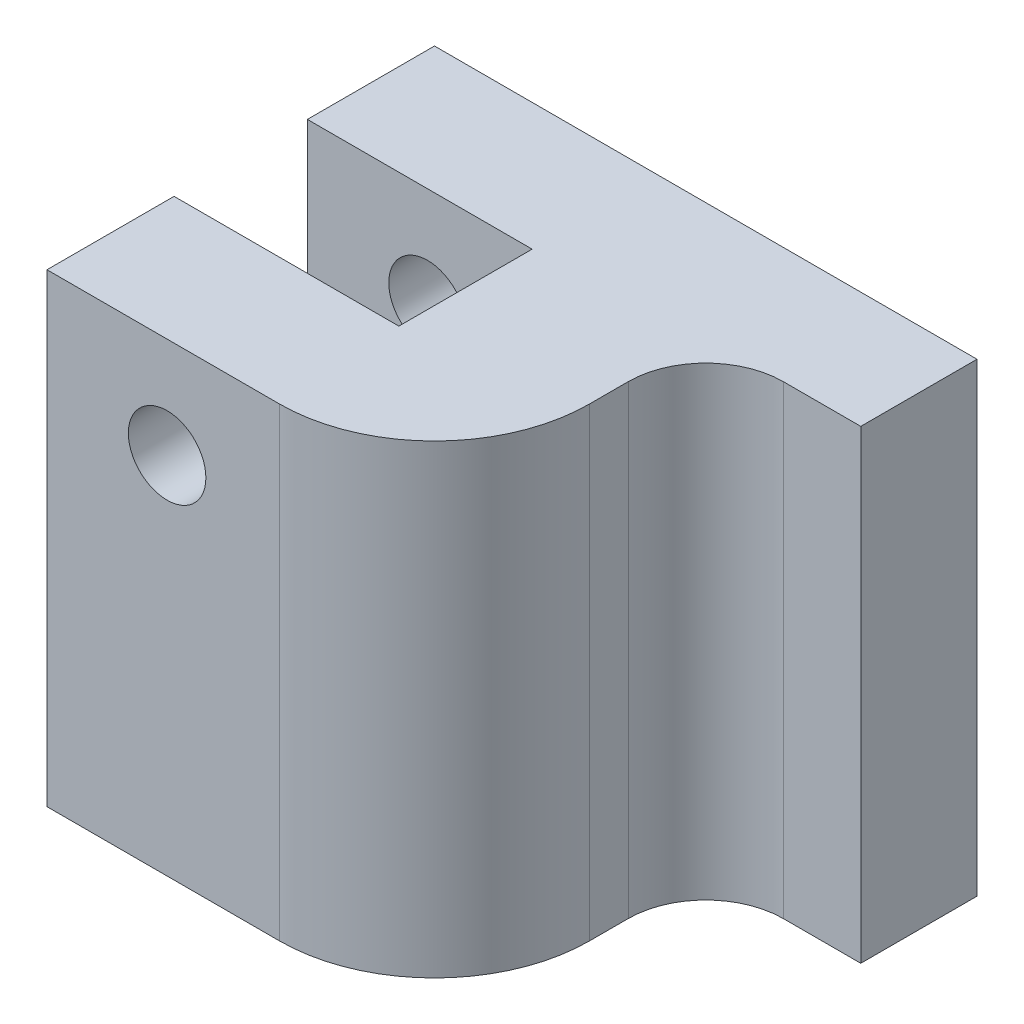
ISO-10303-21;
HEADER;
FILE_DESCRIPTION(('STEP AP214'),'2;1');
FILE_NAME('part.step','',(''),(''),'','','');
FILE_SCHEMA(('AUTOMOTIVE_DESIGN { 1 0 10303 214 1 1 1 1 }'));
ENDSEC;
DATA;
#1=APPLICATION_CONTEXT('core data for automotive mechanical design processes');
#2=APPLICATION_PROTOCOL_DEFINITION('international standard','automotive_design',2000,#1);
#3=PRODUCT_CONTEXT('',#1,'mechanical');
#4=PRODUCT('Part','Part','',(#3));
#5=PRODUCT_RELATED_PRODUCT_CATEGORY('part','',(#4));
#6=PRODUCT_DEFINITION_FORMATION('','',#4);
#7=PRODUCT_DEFINITION_CONTEXT('part definition',#1,'design');
#8=PRODUCT_DEFINITION('design','',#6,#7);
#9=PRODUCT_DEFINITION_SHAPE('','',#8);
#10=(LENGTH_UNIT() NAMED_UNIT(*) SI_UNIT(.MILLI.,.METRE.));
#11=(NAMED_UNIT(*) PLANE_ANGLE_UNIT() SI_UNIT($,.RADIAN.));
#12=(NAMED_UNIT(*) SI_UNIT($,.STERADIAN.) SOLID_ANGLE_UNIT());
#13=UNCERTAINTY_MEASURE_WITH_UNIT(LENGTH_MEASURE(1.E-05),#10,'distance_accuracy_value','');
#14=(GEOMETRIC_REPRESENTATION_CONTEXT(3) GLOBAL_UNCERTAINTY_ASSIGNED_CONTEXT((#13)) GLOBAL_UNIT_ASSIGNED_CONTEXT((#10,
#11,#12)) REPRESENTATION_CONTEXT('',''));
#15=CARTESIAN_POINT('',(0.,0.,0.));
#16=DIRECTION('',(0.,0.,1.));
#17=DIRECTION('',(1.,0.,0.));
#18=AXIS2_PLACEMENT_3D('',#15,#16,#17);
#19=CARTESIAN_POINT('',(0.,38.1,-31.75));
#20=DIRECTION('',(0.,-1.,0.));
#21=DIRECTION('',(0.,0.,1.));
#22=AXIS2_PLACEMENT_3D('',#19,#20,#21);
#23=PLANE('',#22);
#24=DIRECTION('',(0.,0.,1.));
#25=VECTOR('',#24,1.);
#26=CARTESIAN_POINT('',(31.75,38.1,0.));
#27=LINE('',#26,#25);
#28=CARTESIAN_POINT('',(31.75,38.1,-15.875));
#29=VERTEX_POINT('',#28);
#30=CARTESIAN_POINT('',(31.75,38.1,-12.7));
#31=VERTEX_POINT('',#30);
#32=EDGE_CURVE('E125',#29,#31,#27,.T.);
#33=ORIENTED_EDGE('',*,*,#32,.F.);
#34=CARTESIAN_POINT('',(38.1,38.1,-15.875));
#35=DIRECTION('',(0.,1.,0.));
#36=DIRECTION('',(0.,0.,1.));
#37=AXIS2_PLACEMENT_3D('',#34,#35,#36);
#38=CIRCLE('',#37,6.34999999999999);
#39=CARTESIAN_POINT('',(38.1,38.1,-22.225));
#40=VERTEX_POINT('',#39);
#41=EDGE_CURVE('E134',#40,#29,#38,.T.);
#42=ORIENTED_EDGE('',*,*,#41,.F.);
#43=DIRECTION('',(-1.,0.,0.));
#44=VECTOR('',#43,1.);
#45=CARTESIAN_POINT('',(0.,38.1,-22.225));
#46=LINE('',#45,#44);
#47=CARTESIAN_POINT('',(44.45,38.1,-22.225));
#48=VERTEX_POINT('',#47);
#49=EDGE_CURVE('E140',#48,#40,#46,.T.);
#50=ORIENTED_EDGE('',*,*,#49,.F.);
#51=DIRECTION('',(0.,0.,1.));
#52=VECTOR('',#51,1.);
#53=CARTESIAN_POINT('',(44.45,38.1,-31.75));
#54=LINE('',#53,#52);
#55=CARTESIAN_POINT('',(44.45,38.1,-31.75));
#56=VERTEX_POINT('',#55);
#57=EDGE_CURVE('E153',#56,#48,#54,.T.);
#58=ORIENTED_EDGE('',*,*,#57,.F.);
#59=DIRECTION('',(-1.,0.,0.));
#60=VECTOR('',#59,1.);
#61=CARTESIAN_POINT('',(0.,38.1,-31.75));
#62=LINE('',#61,#60);
#63=CARTESIAN_POINT('',(0.,38.1,-31.75));
#64=VERTEX_POINT('',#63);
#65=EDGE_CURVE('E226',#56,#64,#62,.T.);
#66=ORIENTED_EDGE('',*,*,#65,.T.);
#67=DIRECTION('',(0.,0.,1.));
#68=VECTOR('',#67,1.);
#69=CARTESIAN_POINT('',(0.,38.1,-31.75));
#70=LINE('',#69,#68);
#71=CARTESIAN_POINT('',(0.,38.1,-21.336));
#72=VERTEX_POINT('',#71);
#73=EDGE_CURVE('E218',#64,#72,#70,.T.);
#74=ORIENTED_EDGE('',*,*,#73,.T.);
#75=DIRECTION('',(1.,0.,0.));
#76=VECTOR('',#75,1.);
#77=CARTESIAN_POINT('',(18.415,38.1,-21.336));
#78=LINE('',#77,#76);
#79=CARTESIAN_POINT('',(18.415,38.1,-21.336));
#80=VERTEX_POINT('',#79);
#81=EDGE_CURVE('E208',#72,#80,#78,.T.);
#82=ORIENTED_EDGE('',*,*,#81,.T.);
#83=DIRECTION('',(0.,0.,1.));
#84=VECTOR('',#83,1.);
#85=CARTESIAN_POINT('',(18.415,38.1,-10.414));
#86=LINE('',#85,#84);
#87=CARTESIAN_POINT('',(18.415,38.1,-10.414));
#88=VERTEX_POINT('',#87);
#89=EDGE_CURVE('E199',#80,#88,#86,.T.);
#90=ORIENTED_EDGE('',*,*,#89,.T.);
#91=DIRECTION('',(-1.,0.,0.));
#92=VECTOR('',#91,1.);
#93=CARTESIAN_POINT('',(18.415,38.1,-10.414));
#94=LINE('',#93,#92);
#95=CARTESIAN_POINT('',(0.,38.1,-10.414));
#96=VERTEX_POINT('',#95);
#97=EDGE_CURVE('E204',#88,#96,#94,.T.);
#98=ORIENTED_EDGE('',*,*,#97,.T.);
#99=CARTESIAN_POINT('',(0.,38.1,0.));
#100=VERTEX_POINT('',#99);
#101=EDGE_CURVE('E217',#96,#100,#70,.T.);
#102=ORIENTED_EDGE('',*,*,#101,.T.);
#103=DIRECTION('',(-1.,0.,0.));
#104=VECTOR('',#103,1.);
#105=CARTESIAN_POINT('',(0.,38.1,0.));
#106=LINE('',#105,#104);
#107=CARTESIAN_POINT('',(19.05,38.1,0.));
#108=VERTEX_POINT('',#107);
#109=EDGE_CURVE('E143',#108,#100,#106,.T.);
#110=ORIENTED_EDGE('',*,*,#109,.F.);
#111=CARTESIAN_POINT('',(19.05,38.1,-12.7));
#112=DIRECTION('',(0.,1.,0.));
#113=DIRECTION('',(0.,0.,1.));
#114=AXIS2_PLACEMENT_3D('',#111,#112,#113);
#115=CIRCLE('',#114,12.7);
#116=EDGE_CURVE('E11',#31,#108,#115,.F.);
#117=ORIENTED_EDGE('',*,*,#116,.F.);
#118=EDGE_LOOP('',(#33,#42,#50,#58,#66,#74,#82,#90,#98,#102,#110,#117));
#119=FACE_BOUND('',#118,.T.);
#120=ADVANCED_FACE('F37',(#119),#23,.F.);
#121=CARTESIAN_POINT('',(9.8425,29.845,-31.75));
#122=DIRECTION('',(0.,0.,1.));
#123=DIRECTION('',(-1.,0.,0.));
#124=AXIS2_PLACEMENT_3D('',#121,#122,#123);
#125=CYLINDRICAL_SURFACE('',#124,3.175);
#126=CARTESIAN_POINT('',(9.8425,29.845,-21.336));
#127=DIRECTION('',(0.,0.,1.));
#128=DIRECTION('',(1.,0.,0.));
#129=AXIS2_PLACEMENT_3D('',#126,#127,#128);
#130=CIRCLE('',#129,3.175);
#131=CARTESIAN_POINT('',(13.0175,29.845,-21.336));
#132=VERTEX_POINT('',#131);
#133=EDGE_CURVE('E212',#132,#132,#130,.T.);
#134=ORIENTED_EDGE('',*,*,#133,.T.);
#135=EDGE_LOOP('',(#134));
#136=FACE_BOUND('',#135,.T.);
#137=CARTESIAN_POINT('',(9.8425,29.845,-31.75));
#138=DIRECTION('',(0.,0.,1.));
#139=DIRECTION('',(1.,0.,0.));
#140=AXIS2_PLACEMENT_3D('',#137,#138,#139);
#141=CIRCLE('',#140,3.175);
#142=CARTESIAN_POINT('',(13.0175,29.845,-31.75));
#143=VERTEX_POINT('',#142);
#144=EDGE_CURVE('E146',#143,#143,#141,.T.);
#145=ORIENTED_EDGE('',*,*,#144,.F.);
#146=EDGE_LOOP('',(#145));
#147=FACE_BOUND('',#146,.T.);
#148=ADVANCED_FACE('F254',(#136,#147),#125,.F.);
#149=CARTESIAN_POINT('',(0.,0.,-31.75));
#150=DIRECTION('',(0.,0.,1.));
#151=DIRECTION('',(-1.,0.,0.));
#152=AXIS2_PLACEMENT_3D('',#149,#150,#151);
#153=PLANE('',#152);
#154=DIRECTION('',(0.,-1.,0.));
#155=VECTOR('',#154,1.);
#156=CARTESIAN_POINT('',(0.,0.,-31.75));
#157=LINE('',#156,#155);
#158=CARTESIAN_POINT('',(0.,0.,-31.75));
#159=VERTEX_POINT('',#158);
#160=EDGE_CURVE('E222',#64,#159,#157,.T.);
#161=ORIENTED_EDGE('',*,*,#160,.F.);
#162=ORIENTED_EDGE('',*,*,#65,.F.);
#163=DIRECTION('',(0.,1.,0.));
#164=VECTOR('',#163,1.);
#165=CARTESIAN_POINT('',(44.45,0.,-31.75));
#166=LINE('',#165,#164);
#167=CARTESIAN_POINT('',(44.45,0.,-31.75));
#168=VERTEX_POINT('',#167);
#169=EDGE_CURVE('E232',#168,#56,#166,.T.);
#170=ORIENTED_EDGE('',*,*,#169,.F.);
#171=DIRECTION('',(1.,0.,0.));
#172=VECTOR('',#171,1.);
#173=CARTESIAN_POINT('',(0.,0.,-31.75));
#174=LINE('',#173,#172);
#175=EDGE_CURVE('E229',#159,#168,#174,.T.);
#176=ORIENTED_EDGE('',*,*,#175,.F.);
#177=EDGE_LOOP('',(#161,#162,#170,#176));
#178=FACE_BOUND('',#177,.T.);
#179=ORIENTED_EDGE('',*,*,#144,.T.);
#180=EDGE_LOOP('',(#179));
#181=FACE_BOUND('',#180,.T.);
#182=ADVANCED_FACE('F289',(#178,#181),#153,.F.);
#183=CARTESIAN_POINT('',(0.,0.,0.));
#184=DIRECTION('',(0.,0.,1.));
#185=DIRECTION('',(-1.,0.,0.));
#186=AXIS2_PLACEMENT_3D('',#183,#184,#185);
#187=PLANE('',#186);
#188=ORIENTED_EDGE('',*,*,#109,.T.);
#189=DIRECTION('',(0.,-1.,0.));
#190=VECTOR('',#189,1.);
#191=CARTESIAN_POINT('',(0.,0.,0.));
#192=LINE('',#191,#190);
#193=CARTESIAN_POINT('',(0.,0.,0.));
#194=VERTEX_POINT('',#193);
#195=EDGE_CURVE('E236',#100,#194,#192,.T.);
#196=ORIENTED_EDGE('',*,*,#195,.T.);
#197=DIRECTION('',(1.,0.,0.));
#198=VECTOR('',#197,1.);
#199=CARTESIAN_POINT('',(0.,0.,0.));
#200=LINE('',#199,#198);
#201=CARTESIAN_POINT('',(19.05,0.,0.));
#202=VERTEX_POINT('',#201);
#203=EDGE_CURVE('E240',#194,#202,#200,.T.);
#204=ORIENTED_EDGE('',*,*,#203,.T.);
#205=DIRECTION('',(0.,-1.,0.));
#206=VECTOR('',#205,1.);
#207=CARTESIAN_POINT('',(19.05,0.,0.));
#208=LINE('',#207,#206);
#209=EDGE_CURVE('E154',#108,#202,#208,.T.);
#210=ORIENTED_EDGE('',*,*,#209,.F.);
#211=EDGE_LOOP('',(#188,#196,#204,#210));
#212=FACE_BOUND('',#211,.T.);
#213=CARTESIAN_POINT('',(9.8425,29.845,0.));
#214=DIRECTION('',(0.,0.,1.));
#215=DIRECTION('',(1.,0.,0.));
#216=AXIS2_PLACEMENT_3D('',#213,#214,#215);
#217=CIRCLE('',#216,3.175);
#218=CARTESIAN_POINT('',(13.0175,29.845,0.));
#219=VERTEX_POINT('',#218);
#220=EDGE_CURVE('E223',#219,#219,#217,.T.);
#221=ORIENTED_EDGE('',*,*,#220,.F.);
#222=EDGE_LOOP('',(#221));
#223=FACE_BOUND('',#222,.T.);
#224=ADVANCED_FACE('F284',(#212,#223),#187,.T.);
#225=CARTESIAN_POINT('',(0.,0.,-31.75));
#226=DIRECTION('',(1.,0.,0.));
#227=DIRECTION('',(0.,1.,0.));
#228=AXIS2_PLACEMENT_3D('',#225,#226,#227);
#229=PLANE('',#228);
#230=ORIENTED_EDGE('',*,*,#73,.F.);
#231=ORIENTED_EDGE('',*,*,#160,.T.);
#232=DIRECTION('',(0.,0.,1.));
#233=VECTOR('',#232,1.);
#234=CARTESIAN_POINT('',(0.,0.,-31.75));
#235=LINE('',#234,#233);
#236=EDGE_CURVE('E239',#159,#194,#235,.T.);
#237=ORIENTED_EDGE('',*,*,#236,.T.);
#238=ORIENTED_EDGE('',*,*,#195,.F.);
#239=ORIENTED_EDGE('',*,*,#101,.F.);
#240=DIRECTION('',(0.,1.,0.));
#241=VECTOR('',#240,1.);
#242=CARTESIAN_POINT('',(0.,21.3868,-10.414));
#243=LINE('',#242,#241);
#244=CARTESIAN_POINT('',(0.,21.3868,-10.414));
#245=VERTEX_POINT('',#244);
#246=EDGE_CURVE('E215',#245,#96,#243,.T.);
#247=ORIENTED_EDGE('',*,*,#246,.F.);
#248=DIRECTION('',(0.,0.,-1.));
#249=VECTOR('',#248,1.);
#250=CARTESIAN_POINT('',(0.,21.3868,-10.414));
#251=LINE('',#250,#249);
#252=CARTESIAN_POINT('',(0.,21.3868,-21.336));
#253=VERTEX_POINT('',#252);
#254=EDGE_CURVE('E195',#245,#253,#251,.T.);
#255=ORIENTED_EDGE('',*,*,#254,.T.);
#256=DIRECTION('',(0.,1.,0.));
#257=VECTOR('',#256,1.);
#258=CARTESIAN_POINT('',(0.,21.3868,-21.336));
#259=LINE('',#258,#257);
#260=EDGE_CURVE('E211',#253,#72,#259,.T.);
#261=ORIENTED_EDGE('',*,*,#260,.T.);
#262=EDGE_LOOP('',(#230,#231,#237,#238,#239,#247,#255,#261));
#263=FACE_BOUND('',#262,.T.);
#264=ADVANCED_FACE('F271',(#263),#229,.F.);
#265=CARTESIAN_POINT('',(0.,0.,-31.75));
#266=DIRECTION('',(0.,1.,0.));
#267=DIRECTION('',(0.,0.,-1.));
#268=AXIS2_PLACEMENT_3D('',#265,#266,#267);
#269=PLANE('',#268);
#270=CARTESIAN_POINT('',(12.7,0.,-5.715));
#271=DIRECTION('',(0.,1.,0.));
#272=DIRECTION('',(0.,0.,1.));
#273=AXIS2_PLACEMENT_3D('',#270,#271,#272);
#274=CIRCLE('',#273,2.0193);
#275=CARTESIAN_POINT('',(12.7,0.,-3.6957));
#276=VERTEX_POINT('',#275);
#277=EDGE_CURVE('E173',#276,#276,#274,.T.);
#278=ORIENTED_EDGE('',*,*,#277,.T.);
#279=EDGE_LOOP('',(#278));
#280=FACE_BOUND('',#279,.T.);
#281=CARTESIAN_POINT('',(38.1,0.,-26.035));
#282=DIRECTION('',(0.,1.,0.));
#283=DIRECTION('',(0.,0.,1.));
#284=AXIS2_PLACEMENT_3D('',#281,#282,#283);
#285=CIRCLE('',#284,2.01929999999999);
#286=CARTESIAN_POINT('',(38.1,0.,-24.0157));
#287=VERTEX_POINT('',#286);
#288=EDGE_CURVE('E179',#287,#287,#285,.T.);
#289=ORIENTED_EDGE('',*,*,#288,.T.);
#290=EDGE_LOOP('',(#289));
#291=FACE_BOUND('',#290,.T.);
#292=CARTESIAN_POINT('',(12.7,0.,-26.035));
#293=DIRECTION('',(0.,1.,0.));
#294=DIRECTION('',(0.,0.,1.));
#295=AXIS2_PLACEMENT_3D('',#292,#293,#294);
#296=CIRCLE('',#295,2.0193);
#297=CARTESIAN_POINT('',(12.7,0.,-24.0157));
#298=VERTEX_POINT('',#297);
#299=EDGE_CURVE('E185',#298,#298,#296,.T.);
#300=ORIENTED_EDGE('',*,*,#299,.T.);
#301=EDGE_LOOP('',(#300));
#302=FACE_BOUND('',#301,.T.);
#303=ORIENTED_EDGE('',*,*,#203,.F.);
#304=ORIENTED_EDGE('',*,*,#236,.F.);
#305=ORIENTED_EDGE('',*,*,#175,.T.);
#306=DIRECTION('',(0.,0.,1.));
#307=VECTOR('',#306,1.);
#308=CARTESIAN_POINT('',(44.45,0.,-31.75));
#309=LINE('',#308,#307);
#310=CARTESIAN_POINT('',(44.45,0.,-22.225));
#311=VERTEX_POINT('',#310);
#312=EDGE_CURVE('E203',#168,#311,#309,.T.);
#313=ORIENTED_EDGE('',*,*,#312,.T.);
#314=DIRECTION('',(-1.,0.,0.));
#315=VECTOR('',#314,1.);
#316=CARTESIAN_POINT('',(0.,0.,-22.225));
#317=LINE('',#316,#315);
#318=CARTESIAN_POINT('',(38.1,0.,-22.225));
#319=VERTEX_POINT('',#318);
#320=EDGE_CURVE('E149',#311,#319,#317,.T.);
#321=ORIENTED_EDGE('',*,*,#320,.T.);
#322=CARTESIAN_POINT('',(38.1,0.,-15.875));
#323=DIRECTION('',(0.,1.,0.));
#324=DIRECTION('',(0.,0.,1.));
#325=AXIS2_PLACEMENT_3D('',#322,#323,#324);
#326=CIRCLE('',#325,6.34999999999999);
#327=CARTESIAN_POINT('',(31.75,0.,-15.875));
#328=VERTEX_POINT('',#327);
#329=EDGE_CURVE('E131',#319,#328,#326,.T.);
#330=ORIENTED_EDGE('',*,*,#329,.T.);
#331=DIRECTION('',(0.,0.,1.));
#332=VECTOR('',#331,1.);
#333=CARTESIAN_POINT('',(31.75,0.,0.));
#334=LINE('',#333,#332);
#335=CARTESIAN_POINT('',(31.75,0.,-12.7));
#336=VERTEX_POINT('',#335);
#337=EDGE_CURVE('E127',#328,#336,#334,.T.);
#338=ORIENTED_EDGE('',*,*,#337,.T.);
#339=CARTESIAN_POINT('',(19.05,0.,-12.7));
#340=DIRECTION('',(0.,-1.,0.));
#341=DIRECTION('',(0.,0.,-1.));
#342=AXIS2_PLACEMENT_3D('',#339,#340,#341);
#343=CIRCLE('',#342,12.7);
#344=EDGE_CURVE('E157',#202,#336,#343,.F.);
#345=ORIENTED_EDGE('',*,*,#344,.F.);
#346=EDGE_LOOP('',(#303,#304,#305,#313,#321,#330,#338,#345));
#347=FACE_BOUND('',#346,.T.);
#348=ADVANCED_FACE('F161',(#280,#291,#302,#347),#269,.F.);
#349=CARTESIAN_POINT('',(44.45,0.,-31.75));
#350=DIRECTION('',(-1.,0.,0.));
#351=DIRECTION('',(0.,-1.,0.));
#352=AXIS2_PLACEMENT_3D('',#349,#350,#351);
#353=PLANE('',#352);
#354=ORIENTED_EDGE('',*,*,#312,.F.);
#355=ORIENTED_EDGE('',*,*,#169,.T.);
#356=ORIENTED_EDGE('',*,*,#57,.T.);
#357=DIRECTION('',(0.,-1.,0.));
#358=VECTOR('',#357,1.);
#359=CARTESIAN_POINT('',(44.45,38.1,-22.225));
#360=LINE('',#359,#358);
#361=EDGE_CURVE('E163',#48,#311,#360,.T.);
#362=ORIENTED_EDGE('',*,*,#361,.T.);
#363=EDGE_LOOP('',(#354,#355,#356,#362));
#364=FACE_BOUND('',#363,.T.);
#365=ADVANCED_FACE('F292',(#364),#353,.F.);
#366=CARTESIAN_POINT('',(9.8425,29.845,-10.414));
#367=DIRECTION('',(0.,0.,-1.));
#368=DIRECTION('',(-1.,0.,0.));
#369=AXIS2_PLACEMENT_3D('',#366,#367,#368);
#370=CIRCLE('',#369,3.175);
#371=CARTESIAN_POINT('',(6.6675,29.845,-10.414));
#372=VERTEX_POINT('',#371);
#373=EDGE_CURVE('E207',#372,#372,#370,.T.);
#374=ORIENTED_EDGE('',*,*,#373,.T.);
#375=EDGE_LOOP('',(#374));
#376=FACE_BOUND('',#375,.T.);
#377=ORIENTED_EDGE('',*,*,#220,.T.);
#378=EDGE_LOOP('',(#377));
#379=FACE_BOUND('',#378,.T.);
#380=ADVANCED_FACE('F311',(#376,#379),#125,.F.);
#381=CARTESIAN_POINT('',(18.415,21.3868,-10.414));
#382=DIRECTION('',(1.,0.,0.));
#383=DIRECTION('',(0.,0.,1.));
#384=AXIS2_PLACEMENT_3D('',#381,#382,#383);
#385=PLANE('',#384);
#386=ORIENTED_EDGE('',*,*,#89,.F.);
#387=DIRECTION('',(0.,1.,0.));
#388=VECTOR('',#387,1.);
#389=CARTESIAN_POINT('',(18.415,21.3868,-21.336));
#390=LINE('',#389,#388);
#391=CARTESIAN_POINT('',(18.415,21.3868,-21.336));
#392=VERTEX_POINT('',#391);
#393=EDGE_CURVE('E202',#392,#80,#390,.T.);
#394=ORIENTED_EDGE('',*,*,#393,.F.);
#395=DIRECTION('',(0.,0.,1.));
#396=VECTOR('',#395,1.);
#397=CARTESIAN_POINT('',(18.415,21.3868,-10.414));
#398=LINE('',#397,#396);
#399=CARTESIAN_POINT('',(18.415,21.3868,-10.414));
#400=VERTEX_POINT('',#399);
#401=EDGE_CURVE('E189',#392,#400,#398,.T.);
#402=ORIENTED_EDGE('',*,*,#401,.T.);
#403=DIRECTION('',(0.,1.,0.));
#404=VECTOR('',#403,1.);
#405=CARTESIAN_POINT('',(18.415,21.3868,-10.414));
#406=LINE('',#405,#404);
#407=EDGE_CURVE('E193',#400,#88,#406,.T.);
#408=ORIENTED_EDGE('',*,*,#407,.T.);
#409=EDGE_LOOP('',(#386,#394,#402,#408));
#410=FACE_BOUND('',#409,.T.);
#411=ADVANCED_FACE('F261',(#410),#385,.F.);
#412=CARTESIAN_POINT('',(18.415,21.3868,-21.336));
#413=DIRECTION('',(0.,0.,-1.));
#414=DIRECTION('',(1.,0.,0.));
#415=AXIS2_PLACEMENT_3D('',#412,#413,#414);
#416=PLANE('',#415);
#417=ORIENTED_EDGE('',*,*,#133,.F.);
#418=EDGE_LOOP('',(#417));
#419=FACE_BOUND('',#418,.T.);
#420=ORIENTED_EDGE('',*,*,#81,.F.);
#421=ORIENTED_EDGE('',*,*,#260,.F.);
#422=DIRECTION('',(1.,0.,0.));
#423=VECTOR('',#422,1.);
#424=CARTESIAN_POINT('',(18.415,21.3868,-21.336));
#425=LINE('',#424,#423);
#426=EDGE_CURVE('E188',#253,#392,#425,.T.);
#427=ORIENTED_EDGE('',*,*,#426,.T.);
#428=ORIENTED_EDGE('',*,*,#393,.T.);
#429=EDGE_LOOP('',(#420,#421,#427,#428));
#430=FACE_BOUND('',#429,.T.);
#431=ADVANCED_FACE('F257',(#419,#430),#416,.F.);
#432=CARTESIAN_POINT('',(18.415,21.3868,-10.414));
#433=DIRECTION('',(0.,0.,1.));
#434=DIRECTION('',(-1.,0.,0.));
#435=AXIS2_PLACEMENT_3D('',#432,#433,#434);
#436=PLANE('',#435);
#437=ORIENTED_EDGE('',*,*,#373,.F.);
#438=EDGE_LOOP('',(#437));
#439=FACE_BOUND('',#438,.T.);
#440=ORIENTED_EDGE('',*,*,#97,.F.);
#441=ORIENTED_EDGE('',*,*,#407,.F.);
#442=DIRECTION('',(-1.,0.,0.));
#443=VECTOR('',#442,1.);
#444=CARTESIAN_POINT('',(18.415,21.3868,-10.414));
#445=LINE('',#444,#443);
#446=EDGE_CURVE('E192',#400,#245,#445,.T.);
#447=ORIENTED_EDGE('',*,*,#446,.T.);
#448=ORIENTED_EDGE('',*,*,#246,.T.);
#449=EDGE_LOOP('',(#440,#441,#447,#448));
#450=FACE_BOUND('',#449,.T.);
#451=ADVANCED_FACE('F260',(#439,#450),#436,.F.);
#452=CARTESIAN_POINT('',(0.,21.3868,0.));
#453=DIRECTION('',(0.,-1.,0.));
#454=DIRECTION('',(0.,0.,1.));
#455=AXIS2_PLACEMENT_3D('',#452,#453,#454);
#456=PLANE('',#455);
#457=ORIENTED_EDGE('',*,*,#401,.F.);
#458=ORIENTED_EDGE('',*,*,#426,.F.);
#459=ORIENTED_EDGE('',*,*,#254,.F.);
#460=ORIENTED_EDGE('',*,*,#446,.F.);
#461=EDGE_LOOP('',(#457,#458,#459,#460));
#462=FACE_BOUND('',#461,.T.);
#463=ADVANCED_FACE('F277',(#462),#456,.F.);
#464=CARTESIAN_POINT('',(12.7,19.05,-26.035));
#465=DIRECTION('',(0.,-1.,0.));
#466=DIRECTION('',(0.,0.,1.));
#467=AXIS2_PLACEMENT_3D('',#464,#465,#466);
#468=CYLINDRICAL_SURFACE('',#467,2.0193);
#469=CARTESIAN_POINT('',(12.7,19.05,-26.035));
#470=DIRECTION('',(0.,1.,0.));
#471=DIRECTION('',(0.,0.,1.));
#472=AXIS2_PLACEMENT_3D('',#469,#470,#471);
#473=CIRCLE('',#472,2.0193);
#474=CARTESIAN_POINT('',(12.7,19.05,-24.0157));
#475=VERTEX_POINT('',#474);
#476=EDGE_CURVE('E182',#475,#475,#473,.T.);
#477=CARTESIAN_POINT('',(12.7,19.05,-24.0157));
#478=CARTESIAN_POINT('',(12.7,18.8515625,-24.0157));
#479=CARTESIAN_POINT('',(12.7,18.653125,-24.0157));
#480=CARTESIAN_POINT('',(12.7,18.25625,-24.0157));
#481=CARTESIAN_POINT('',(12.7,18.0578125,-24.0157));
#482=CARTESIAN_POINT('',(12.7,17.6609375,-24.0157));
#483=CARTESIAN_POINT('',(12.7,17.4625,-24.0157));
#484=CARTESIAN_POINT('',(12.7,17.065625,-24.0157));
#485=CARTESIAN_POINT('',(12.7,16.8671875,-24.0157));
#486=CARTESIAN_POINT('',(12.7,16.4703125,-24.0157));
#487=CARTESIAN_POINT('',(12.7,16.271875,-24.0157));
#488=CARTESIAN_POINT('',(12.7,15.875,-24.0157));
#489=CARTESIAN_POINT('',(12.7,15.6765625,-24.0157));
#490=CARTESIAN_POINT('',(12.7,15.2796875,-24.0157));
#491=CARTESIAN_POINT('',(12.7,15.08125,-24.0157));
#492=CARTESIAN_POINT('',(12.7,14.684375,-24.0157));
#493=CARTESIAN_POINT('',(12.7,14.4859375,-24.0157));
#494=CARTESIAN_POINT('',(12.7,14.0890625,-24.0157));
#495=CARTESIAN_POINT('',(12.7,13.890625,-24.0157));
#496=CARTESIAN_POINT('',(12.7,13.49375,-24.0157));
#497=CARTESIAN_POINT('',(12.7,13.2953125,-24.0157));
#498=CARTESIAN_POINT('',(12.7,12.8984375,-24.0157));
#499=CARTESIAN_POINT('',(12.7,12.7,-24.0157));
#500=CARTESIAN_POINT('',(12.7,12.303125,-24.0157));
#501=CARTESIAN_POINT('',(12.7,12.1046875,-24.0157));
#502=CARTESIAN_POINT('',(12.7,11.7078125,-24.0157));
#503=CARTESIAN_POINT('',(12.7,11.509375,-24.0157));
#504=CARTESIAN_POINT('',(12.7,11.1125,-24.0157));
#505=CARTESIAN_POINT('',(12.7,10.9140625,-24.0157));
#506=CARTESIAN_POINT('',(12.7,10.5171875,-24.0157));
#507=CARTESIAN_POINT('',(12.7,10.31875,-24.0157));
#508=CARTESIAN_POINT('',(12.7,9.921875,-24.0157));
#509=CARTESIAN_POINT('',(12.7,9.7234375,-24.0157));
#510=CARTESIAN_POINT('',(12.7,9.3265625,-24.0157));
#511=CARTESIAN_POINT('',(12.7,9.128125,-24.0157));
#512=CARTESIAN_POINT('',(12.7,8.73125,-24.0157));
#513=CARTESIAN_POINT('',(12.7,8.5328125,-24.0157));
#514=CARTESIAN_POINT('',(12.7,8.1359375,-24.0157));
#515=CARTESIAN_POINT('',(12.7,7.9375,-24.0157));
#516=CARTESIAN_POINT('',(12.7,7.540625,-24.0157));
#517=CARTESIAN_POINT('',(12.7,7.3421875,-24.0157));
#518=CARTESIAN_POINT('',(12.7,6.9453125,-24.0157));
#519=CARTESIAN_POINT('',(12.7,6.746875,-24.0157));
#520=CARTESIAN_POINT('',(12.7,6.35,-24.0157));
#521=CARTESIAN_POINT('',(12.7,6.1515625,-24.0157));
#522=CARTESIAN_POINT('',(12.7,5.7546875,-24.0157));
#523=CARTESIAN_POINT('',(12.7,5.55625,-24.0157));
#524=CARTESIAN_POINT('',(12.7,5.159375,-24.0157));
#525=CARTESIAN_POINT('',(12.7,4.9609375,-24.0157));
#526=CARTESIAN_POINT('',(12.7,4.5640625,-24.0157));
#527=CARTESIAN_POINT('',(12.7,4.365625,-24.0157));
#528=CARTESIAN_POINT('',(12.7,3.96875,-24.0157));
#529=CARTESIAN_POINT('',(12.7,3.7703125,-24.0157));
#530=CARTESIAN_POINT('',(12.7,3.3734375,-24.0157));
#531=CARTESIAN_POINT('',(12.7,3.175,-24.0157));
#532=CARTESIAN_POINT('',(12.7,2.778125,-24.0157));
#533=CARTESIAN_POINT('',(12.7,2.5796875,-24.0157));
#534=CARTESIAN_POINT('',(12.7,2.1828125,-24.0157));
#535=CARTESIAN_POINT('',(12.7,1.984375,-24.0157));
#536=CARTESIAN_POINT('',(12.7,1.5875,-24.0157));
#537=CARTESIAN_POINT('',(12.7,1.3890625,-24.0157));
#538=CARTESIAN_POINT('',(12.7,0.992187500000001,-24.0157));
#539=CARTESIAN_POINT('',(12.7,0.793750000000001,-24.0157));
#540=CARTESIAN_POINT('',(12.7,0.396875,-24.0157));
#541=CARTESIAN_POINT('',(12.7,0.1984375,-24.0157));
#542=CARTESIAN_POINT('',(12.7,0.,-24.0157));
#543=B_SPLINE_CURVE_WITH_KNOTS('',3,(#477,#478,#479,#480,#481,#482,#483,#484,#485,#486,#487,
#488,#489,#490,#491,#492,#493,#494,#495,#496,#497,#498,#499,#500,#501,#502,#503,#504,#505,#506,
#507,#508,#509,#510,#511,#512,#513,#514,#515,#516,#517,#518,#519,#520,#521,#522,#523,#524,#525,
#526,#527,#528,#529,#530,#531,#532,#533,#534,#535,#536,#537,#538,#539,#540,#541,#542),
.UNSPECIFIED.,.F.,.F.,(4,2,2,2,2,2,2,2,2,2,2,2,2,2,2,2,2,2,2,2,2,2,2,2,2,2,2,2,2,2,2,2,4),(0.,
0.5953125,1.190625,1.7859375,2.38125,2.9765625,3.571875,4.1671875,4.7625,5.3578125,5.953125,
6.5484375,7.14375,7.7390625,8.334375,8.9296875,9.525,10.1203125,10.715625,11.3109375,11.90625,
12.5015625,13.096875,13.6921875,14.2875,14.8828125,15.478125,16.0734375,16.66875,17.2640625,
17.859375,18.4546875,19.05),.UNSPECIFIED.);
#544=EDGE_CURVE('BSEAM377',#475,#298,#543,.T.);
#545=ORIENTED_EDGE('',*,*,#476,.T.);
#546=ORIENTED_EDGE('',*,*,#299,.F.);
#547=ORIENTED_EDGE('',*,*,#544,.T.);
#548=ORIENTED_EDGE('',*,*,#544,.F.);
#549=EDGE_LOOP('',(#545,#547,#546,#548));
#550=FACE_BOUND('',#549,.T.);
#551=ADVANCED_FACE('F377',(#550),#468,.F.);
#552=CARTESIAN_POINT('',(12.7,19.05,-26.035));
#553=DIRECTION('',(0.,-1.,0.));
#554=DIRECTION('',(0.,0.,1.));
#555=AXIS2_PLACEMENT_3D('',#552,#553,#554);
#556=PLANE('',#555);
#557=ORIENTED_EDGE('',*,*,#476,.F.);
#558=EDGE_LOOP('',(#557));
#559=FACE_BOUND('',#558,.T.);
#560=ADVANCED_FACE('F367',(#559),#556,.T.);
#561=CARTESIAN_POINT('',(38.1,19.05,-26.035));
#562=DIRECTION('',(0.,-1.,0.));
#563=DIRECTION('',(0.,0.,1.));
#564=AXIS2_PLACEMENT_3D('',#561,#562,#563);
#565=CYLINDRICAL_SURFACE('',#564,2.01929999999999);
#566=CARTESIAN_POINT('',(38.1,19.05,-26.035));
#567=DIRECTION('',(0.,1.,0.));
#568=DIRECTION('',(0.,0.,1.));
#569=AXIS2_PLACEMENT_3D('',#566,#567,#568);
#570=CIRCLE('',#569,2.01929999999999);
#571=CARTESIAN_POINT('',(38.1,19.05,-24.0157));
#572=VERTEX_POINT('',#571);
#573=EDGE_CURVE('E176',#572,#572,#570,.T.);
#574=CARTESIAN_POINT('',(38.1,19.05,-24.0157));
#575=CARTESIAN_POINT('',(38.1,18.8515625,-24.0157));
#576=CARTESIAN_POINT('',(38.1,18.653125,-24.0157));
#577=CARTESIAN_POINT('',(38.1,18.25625,-24.0157));
#578=CARTESIAN_POINT('',(38.1,18.0578125,-24.0157));
#579=CARTESIAN_POINT('',(38.1,17.6609375,-24.0157));
#580=CARTESIAN_POINT('',(38.1,17.4625,-24.0157));
#581=CARTESIAN_POINT('',(38.1,17.065625,-24.0157));
#582=CARTESIAN_POINT('',(38.1,16.8671875,-24.0157));
#583=CARTESIAN_POINT('',(38.1,16.4703125,-24.0157));
#584=CARTESIAN_POINT('',(38.1,16.271875,-24.0157));
#585=CARTESIAN_POINT('',(38.1,15.875,-24.0157));
#586=CARTESIAN_POINT('',(38.1,15.6765625,-24.0157));
#587=CARTESIAN_POINT('',(38.1,15.2796875,-24.0157));
#588=CARTESIAN_POINT('',(38.1,15.08125,-24.0157));
#589=CARTESIAN_POINT('',(38.1,14.684375,-24.0157));
#590=CARTESIAN_POINT('',(38.1,14.4859375,-24.0157));
#591=CARTESIAN_POINT('',(38.1,14.0890625,-24.0157));
#592=CARTESIAN_POINT('',(38.1,13.890625,-24.0157));
#593=CARTESIAN_POINT('',(38.1,13.49375,-24.0157));
#594=CARTESIAN_POINT('',(38.1,13.2953125,-24.0157));
#595=CARTESIAN_POINT('',(38.1,12.8984375,-24.0157));
#596=CARTESIAN_POINT('',(38.1,12.7,-24.0157));
#597=CARTESIAN_POINT('',(38.1,12.303125,-24.0157));
#598=CARTESIAN_POINT('',(38.1,12.1046875,-24.0157));
#599=CARTESIAN_POINT('',(38.1,11.7078125,-24.0157));
#600=CARTESIAN_POINT('',(38.1,11.509375,-24.0157));
#601=CARTESIAN_POINT('',(38.1,11.1125,-24.0157));
#602=CARTESIAN_POINT('',(38.1,10.9140625,-24.0157));
#603=CARTESIAN_POINT('',(38.1,10.5171875,-24.0157));
#604=CARTESIAN_POINT('',(38.1,10.31875,-24.0157));
#605=CARTESIAN_POINT('',(38.1,9.921875,-24.0157));
#606=CARTESIAN_POINT('',(38.1,9.7234375,-24.0157));
#607=CARTESIAN_POINT('',(38.1,9.3265625,-24.0157));
#608=CARTESIAN_POINT('',(38.1,9.128125,-24.0157));
#609=CARTESIAN_POINT('',(38.1,8.73125,-24.0157));
#610=CARTESIAN_POINT('',(38.1,8.5328125,-24.0157));
#611=CARTESIAN_POINT('',(38.1,8.1359375,-24.0157));
#612=CARTESIAN_POINT('',(38.1,7.9375,-24.0157));
#613=CARTESIAN_POINT('',(38.1,7.540625,-24.0157));
#614=CARTESIAN_POINT('',(38.1,7.3421875,-24.0157));
#615=CARTESIAN_POINT('',(38.1,6.9453125,-24.0157));
#616=CARTESIAN_POINT('',(38.1,6.746875,-24.0157));
#617=CARTESIAN_POINT('',(38.1,6.35,-24.0157));
#618=CARTESIAN_POINT('',(38.1,6.1515625,-24.0157));
#619=CARTESIAN_POINT('',(38.1,5.7546875,-24.0157));
#620=CARTESIAN_POINT('',(38.1,5.55625,-24.0157));
#621=CARTESIAN_POINT('',(38.1,5.159375,-24.0157));
#622=CARTESIAN_POINT('',(38.1,4.9609375,-24.0157));
#623=CARTESIAN_POINT('',(38.1,4.5640625,-24.0157));
#624=CARTESIAN_POINT('',(38.1,4.365625,-24.0157));
#625=CARTESIAN_POINT('',(38.1,3.96875,-24.0157));
#626=CARTESIAN_POINT('',(38.1,3.7703125,-24.0157));
#627=CARTESIAN_POINT('',(38.1,3.3734375,-24.0157));
#628=CARTESIAN_POINT('',(38.1,3.175,-24.0157));
#629=CARTESIAN_POINT('',(38.1,2.778125,-24.0157));
#630=CARTESIAN_POINT('',(38.1,2.5796875,-24.0157));
#631=CARTESIAN_POINT('',(38.1,2.1828125,-24.0157));
#632=CARTESIAN_POINT('',(38.1,1.984375,-24.0157));
#633=CARTESIAN_POINT('',(38.1,1.5875,-24.0157));
#634=CARTESIAN_POINT('',(38.1,1.3890625,-24.0157));
#635=CARTESIAN_POINT('',(38.1,0.992187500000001,-24.0157));
#636=CARTESIAN_POINT('',(38.1,0.793750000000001,-24.0157));
#637=CARTESIAN_POINT('',(38.1,0.396875,-24.0157));
#638=CARTESIAN_POINT('',(38.1,0.1984375,-24.0157));
#639=CARTESIAN_POINT('',(38.1,0.,-24.0157));
#640=B_SPLINE_CURVE_WITH_KNOTS('',3,(#574,#575,#576,#577,#578,#579,#580,#581,#582,#583,#584,
#585,#586,#587,#588,#589,#590,#591,#592,#593,#594,#595,#596,#597,#598,#599,#600,#601,#602,#603,
#604,#605,#606,#607,#608,#609,#610,#611,#612,#613,#614,#615,#616,#617,#618,#619,#620,#621,#622,
#623,#624,#625,#626,#627,#628,#629,#630,#631,#632,#633,#634,#635,#636,#637,#638,#639),
.UNSPECIFIED.,.F.,.F.,(4,2,2,2,2,2,2,2,2,2,2,2,2,2,2,2,2,2,2,2,2,2,2,2,2,2,2,2,2,2,2,2,4),(0.,
0.5953125,1.190625,1.7859375,2.38125,2.9765625,3.571875,4.1671875,4.7625,5.3578125,5.953125,
6.5484375,7.14375,7.7390625,8.334375,8.9296875,9.525,10.1203125,10.715625,11.3109375,11.90625,
12.5015625,13.096875,13.6921875,14.2875,14.8828125,15.478125,16.0734375,16.66875,17.2640625,
17.859375,18.4546875,19.05),.UNSPECIFIED.);
#641=EDGE_CURVE('BSEAM357',#572,#287,#640,.T.);
#642=ORIENTED_EDGE('',*,*,#573,.T.);
#643=ORIENTED_EDGE('',*,*,#288,.F.);
#644=ORIENTED_EDGE('',*,*,#641,.T.);
#645=ORIENTED_EDGE('',*,*,#641,.F.);
#646=EDGE_LOOP('',(#642,#644,#643,#645));
#647=FACE_BOUND('',#646,.T.);
#648=ADVANCED_FACE('F357',(#647),#565,.F.);
#649=CARTESIAN_POINT('',(38.1,19.05,-26.035));
#650=DIRECTION('',(0.,-1.,0.));
#651=DIRECTION('',(0.,0.,1.));
#652=AXIS2_PLACEMENT_3D('',#649,#650,#651);
#653=PLANE('',#652);
#654=ORIENTED_EDGE('',*,*,#573,.F.);
#655=EDGE_LOOP('',(#654));
#656=FACE_BOUND('',#655,.T.);
#657=ADVANCED_FACE('F347',(#656),#653,.T.);
#658=CARTESIAN_POINT('',(12.7,19.05,-5.715));
#659=DIRECTION('',(0.,-1.,0.));
#660=DIRECTION('',(0.,0.,1.));
#661=AXIS2_PLACEMENT_3D('',#658,#659,#660);
#662=CYLINDRICAL_SURFACE('',#661,2.0193);
#663=CARTESIAN_POINT('',(12.7,19.05,-5.715));
#664=DIRECTION('',(0.,1.,0.));
#665=DIRECTION('',(0.,0.,1.));
#666=AXIS2_PLACEMENT_3D('',#663,#664,#665);
#667=CIRCLE('',#666,2.0193);
#668=CARTESIAN_POINT('',(12.7,19.05,-3.6957));
#669=VERTEX_POINT('',#668);
#670=EDGE_CURVE('E170',#669,#669,#667,.T.);
#671=CARTESIAN_POINT('',(12.7,19.05,-3.6957));
#672=CARTESIAN_POINT('',(12.7,18.8515625,-3.6957));
#673=CARTESIAN_POINT('',(12.7,18.653125,-3.6957));
#674=CARTESIAN_POINT('',(12.7,18.25625,-3.6957));
#675=CARTESIAN_POINT('',(12.7,18.0578125,-3.6957));
#676=CARTESIAN_POINT('',(12.7,17.6609375,-3.6957));
#677=CARTESIAN_POINT('',(12.7,17.4625,-3.6957));
#678=CARTESIAN_POINT('',(12.7,17.065625,-3.6957));
#679=CARTESIAN_POINT('',(12.7,16.8671875,-3.6957));
#680=CARTESIAN_POINT('',(12.7,16.4703125,-3.6957));
#681=CARTESIAN_POINT('',(12.7,16.271875,-3.6957));
#682=CARTESIAN_POINT('',(12.7,15.875,-3.6957));
#683=CARTESIAN_POINT('',(12.7,15.6765625,-3.6957));
#684=CARTESIAN_POINT('',(12.7,15.2796875,-3.6957));
#685=CARTESIAN_POINT('',(12.7,15.08125,-3.6957));
#686=CARTESIAN_POINT('',(12.7,14.684375,-3.6957));
#687=CARTESIAN_POINT('',(12.7,14.4859375,-3.6957));
#688=CARTESIAN_POINT('',(12.7,14.0890625,-3.6957));
#689=CARTESIAN_POINT('',(12.7,13.890625,-3.6957));
#690=CARTESIAN_POINT('',(12.7,13.49375,-3.6957));
#691=CARTESIAN_POINT('',(12.7,13.2953125,-3.6957));
#692=CARTESIAN_POINT('',(12.7,12.8984375,-3.6957));
#693=CARTESIAN_POINT('',(12.7,12.7,-3.6957));
#694=CARTESIAN_POINT('',(12.7,12.303125,-3.6957));
#695=CARTESIAN_POINT('',(12.7,12.1046875,-3.6957));
#696=CARTESIAN_POINT('',(12.7,11.7078125,-3.6957));
#697=CARTESIAN_POINT('',(12.7,11.509375,-3.6957));
#698=CARTESIAN_POINT('',(12.7,11.1125,-3.6957));
#699=CARTESIAN_POINT('',(12.7,10.9140625,-3.6957));
#700=CARTESIAN_POINT('',(12.7,10.5171875,-3.6957));
#701=CARTESIAN_POINT('',(12.7,10.31875,-3.6957));
#702=CARTESIAN_POINT('',(12.7,9.921875,-3.6957));
#703=CARTESIAN_POINT('',(12.7,9.7234375,-3.6957));
#704=CARTESIAN_POINT('',(12.7,9.3265625,-3.6957));
#705=CARTESIAN_POINT('',(12.7,9.128125,-3.6957));
#706=CARTESIAN_POINT('',(12.7,8.73125,-3.6957));
#707=CARTESIAN_POINT('',(12.7,8.5328125,-3.6957));
#708=CARTESIAN_POINT('',(12.7,8.1359375,-3.6957));
#709=CARTESIAN_POINT('',(12.7,7.9375,-3.6957));
#710=CARTESIAN_POINT('',(12.7,7.540625,-3.6957));
#711=CARTESIAN_POINT('',(12.7,7.3421875,-3.6957));
#712=CARTESIAN_POINT('',(12.7,6.9453125,-3.6957));
#713=CARTESIAN_POINT('',(12.7,6.746875,-3.6957));
#714=CARTESIAN_POINT('',(12.7,6.35,-3.6957));
#715=CARTESIAN_POINT('',(12.7,6.1515625,-3.6957));
#716=CARTESIAN_POINT('',(12.7,5.7546875,-3.6957));
#717=CARTESIAN_POINT('',(12.7,5.55625,-3.6957));
#718=CARTESIAN_POINT('',(12.7,5.159375,-3.6957));
#719=CARTESIAN_POINT('',(12.7,4.9609375,-3.6957));
#720=CARTESIAN_POINT('',(12.7,4.5640625,-3.6957));
#721=CARTESIAN_POINT('',(12.7,4.365625,-3.6957));
#722=CARTESIAN_POINT('',(12.7,3.96875,-3.6957));
#723=CARTESIAN_POINT('',(12.7,3.7703125,-3.6957));
#724=CARTESIAN_POINT('',(12.7,3.3734375,-3.6957));
#725=CARTESIAN_POINT('',(12.7,3.175,-3.6957));
#726=CARTESIAN_POINT('',(12.7,2.778125,-3.6957));
#727=CARTESIAN_POINT('',(12.7,2.5796875,-3.6957));
#728=CARTESIAN_POINT('',(12.7,2.1828125,-3.6957));
#729=CARTESIAN_POINT('',(12.7,1.984375,-3.6957));
#730=CARTESIAN_POINT('',(12.7,1.5875,-3.6957));
#731=CARTESIAN_POINT('',(12.7,1.3890625,-3.6957));
#732=CARTESIAN_POINT('',(12.7,0.992187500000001,-3.6957));
#733=CARTESIAN_POINT('',(12.7,0.793750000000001,-3.6957));
#734=CARTESIAN_POINT('',(12.7,0.396875,-3.6957));
#735=CARTESIAN_POINT('',(12.7,0.1984375,-3.6957));
#736=CARTESIAN_POINT('',(12.7,0.,-3.6957));
#737=B_SPLINE_CURVE_WITH_KNOTS('',3,(#671,#672,#673,#674,#675,#676,#677,#678,#679,#680,#681,
#682,#683,#684,#685,#686,#687,#688,#689,#690,#691,#692,#693,#694,#695,#696,#697,#698,#699,#700,
#701,#702,#703,#704,#705,#706,#707,#708,#709,#710,#711,#712,#713,#714,#715,#716,#717,#718,#719,
#720,#721,#722,#723,#724,#725,#726,#727,#728,#729,#730,#731,#732,#733,#734,#735,#736),
.UNSPECIFIED.,.F.,.F.,(4,2,2,2,2,2,2,2,2,2,2,2,2,2,2,2,2,2,2,2,2,2,2,2,2,2,2,2,2,2,2,2,4),(0.,
0.5953125,1.190625,1.7859375,2.38125,2.9765625,3.571875,4.1671875,4.7625,5.3578125,5.953125,
6.5484375,7.14375,7.7390625,8.334375,8.9296875,9.525,10.1203125,10.715625,11.3109375,11.90625,
12.5015625,13.096875,13.6921875,14.2875,14.8828125,15.478125,16.0734375,16.66875,17.2640625,
17.859375,18.4546875,19.05),.UNSPECIFIED.);
#738=EDGE_CURVE('BSEAM302',#669,#276,#737,.T.);
#739=ORIENTED_EDGE('',*,*,#670,.T.);
#740=ORIENTED_EDGE('',*,*,#277,.F.);
#741=ORIENTED_EDGE('',*,*,#738,.T.);
#742=ORIENTED_EDGE('',*,*,#738,.F.);
#743=EDGE_LOOP('',(#739,#741,#740,#742));
#744=FACE_BOUND('',#743,.T.);
#745=ADVANCED_FACE('F302',(#744),#662,.F.);
#746=CARTESIAN_POINT('',(12.7,19.05,-5.715));
#747=DIRECTION('',(0.,-1.,0.));
#748=DIRECTION('',(0.,0.,1.));
#749=AXIS2_PLACEMENT_3D('',#746,#747,#748);
#750=PLANE('',#749);
#751=ORIENTED_EDGE('',*,*,#670,.F.);
#752=EDGE_LOOP('',(#751));
#753=FACE_BOUND('',#752,.T.);
#754=ADVANCED_FACE('F295',(#753),#750,.T.);
#755=CARTESIAN_POINT('',(0.,38.1,-22.225));
#756=DIRECTION('',(0.,0.,-1.));
#757=DIRECTION('',(1.,0.,0.));
#758=AXIS2_PLACEMENT_3D('',#755,#756,#757);
#759=PLANE('',#758);
#760=ORIENTED_EDGE('',*,*,#320,.F.);
#761=ORIENTED_EDGE('',*,*,#361,.F.);
#762=ORIENTED_EDGE('',*,*,#49,.T.);
#763=DIRECTION('',(0.,-1.,0.));
#764=VECTOR('',#763,1.);
#765=CARTESIAN_POINT('',(38.1,38.1,-22.225));
#766=LINE('',#765,#764);
#767=EDGE_CURVE('E136',#40,#319,#766,.T.);
#768=ORIENTED_EDGE('',*,*,#767,.T.);
#769=EDGE_LOOP('',(#760,#761,#762,#768));
#770=FACE_BOUND('',#769,.T.);
#771=ADVANCED_FACE('F293',(#770),#759,.F.);
#772=CARTESIAN_POINT('',(31.75,38.1,0.));
#773=DIRECTION('',(-1.,0.,0.));
#774=DIRECTION('',(0.,0.,-1.));
#775=AXIS2_PLACEMENT_3D('',#772,#773,#774);
#776=PLANE('',#775);
#777=ORIENTED_EDGE('',*,*,#337,.F.);
#778=DIRECTION('',(0.,-1.,0.));
#779=VECTOR('',#778,1.);
#780=CARTESIAN_POINT('',(31.75,38.1,-15.875));
#781=LINE('',#780,#779);
#782=EDGE_CURVE('E121',#29,#328,#781,.T.);
#783=ORIENTED_EDGE('',*,*,#782,.F.);
#784=ORIENTED_EDGE('',*,*,#32,.T.);
#785=DIRECTION('',(0.,-1.,0.));
#786=VECTOR('',#785,1.);
#787=CARTESIAN_POINT('',(31.75,38.1,-12.7));
#788=LINE('',#787,#786);
#789=EDGE_CURVE('E45',#336,#31,#788,.F.);
#790=ORIENTED_EDGE('',*,*,#789,.F.);
#791=EDGE_LOOP('',(#777,#783,#784,#790));
#792=FACE_BOUND('',#791,.T.);
#793=ADVANCED_FACE('F123',(#792),#776,.F.);
#794=CARTESIAN_POINT('',(38.1,38.1,-15.875));
#795=DIRECTION('',(0.,-1.,0.));
#796=DIRECTION('',(0.,0.,1.));
#797=AXIS2_PLACEMENT_3D('',#794,#795,#796);
#798=CYLINDRICAL_SURFACE('',#797,6.34999999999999);
#799=ORIENTED_EDGE('',*,*,#329,.F.);
#800=ORIENTED_EDGE('',*,*,#767,.F.);
#801=ORIENTED_EDGE('',*,*,#41,.T.);
#802=ORIENTED_EDGE('',*,*,#782,.T.);
#803=EDGE_LOOP('',(#799,#800,#801,#802));
#804=FACE_BOUND('',#803,.T.);
#805=ADVANCED_FACE('F135',(#804),#798,.F.);
#806=CARTESIAN_POINT('',(19.05,0.,-12.7));
#807=DIRECTION('',(0.,1.,0.));
#808=DIRECTION('',(0.,0.,-1.));
#809=AXIS2_PLACEMENT_3D('',#806,#807,#808);
#810=CYLINDRICAL_SURFACE('',#809,12.7);
#811=ORIENTED_EDGE('',*,*,#116,.T.);
#812=ORIENTED_EDGE('',*,*,#209,.T.);
#813=ORIENTED_EDGE('',*,*,#344,.T.);
#814=ORIENTED_EDGE('',*,*,#789,.T.);
#815=EDGE_LOOP('',(#811,#812,#813,#814));
#816=FACE_BOUND('',#815,.T.);
#817=ADVANCED_FACE('F39',(#816),#810,.T.);
#818=CLOSED_SHELL('',(#120,#148,#182,#224,#264,#348,#365,#380,#411,#431,#451,#463,#551,#560,
#648,#657,#745,#754,#771,#793,#805,#817));
#819=MANIFOLD_SOLID_BREP('B2',#818);
#820=ADVANCED_BREP_SHAPE_REPRESENTATION('',(#18,#819),#14);
#821=SHAPE_DEFINITION_REPRESENTATION(#9,#820);
ENDSEC;
END-ISO-10303-21;
